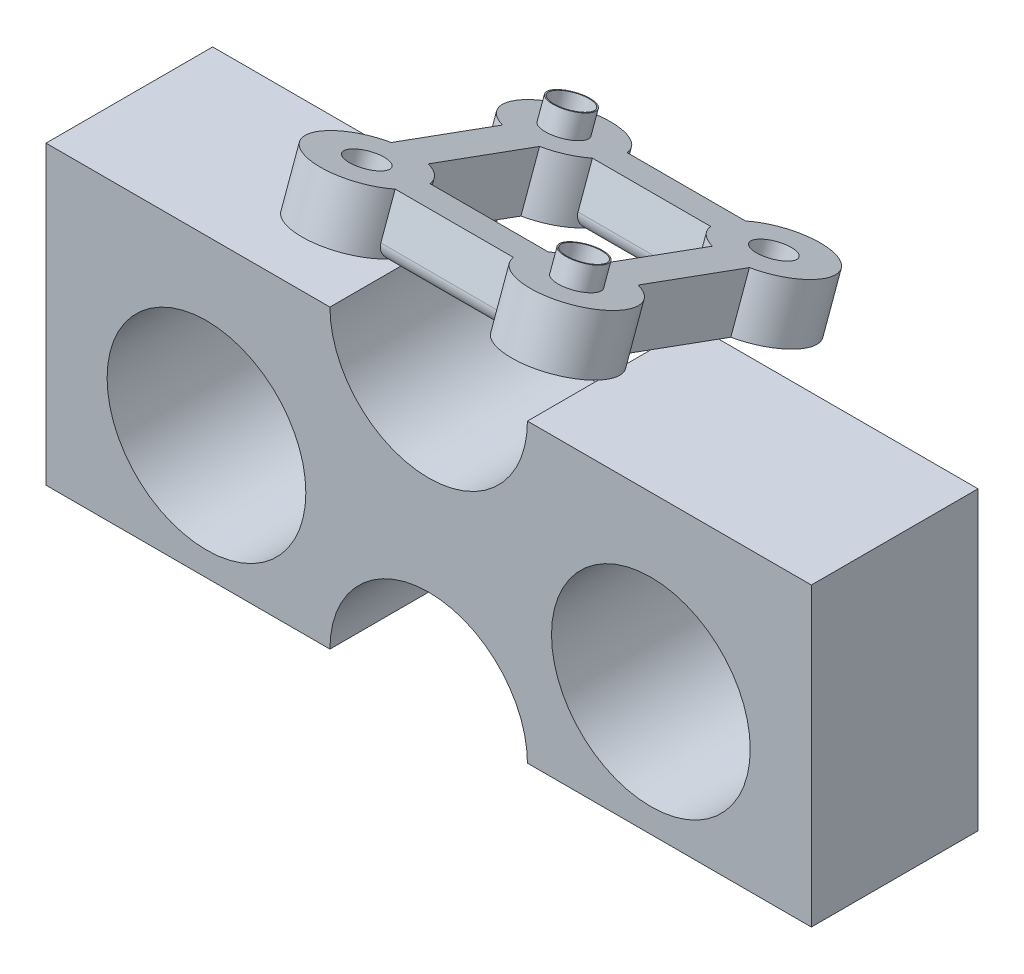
from build123d import *

# Parameters (mm, degrees)
ESQUISSE1_R                     = 8.05
BOSS_EXTRU_1_DEPTH              = 13.5
BOSS_EXTRU_2_DEPTH              = 4.4
ESQUISSE4_R                     = 1.6
BOSS_EXTRU_3_DEPTH              = 1.75
R_P_TITION_LIN_AIRE1_COUNT      = 2
R_P_TITION_LIN_AIRE1_PITCH      = 17
R_P_TITION_LIN_AIRE1_COUNT_DIR2 = 2
R_P_TITION_LIN_AIRE1_PITCH_DIR2 = 17
ENL_V_START                     = -6.15
ESQUISSE5_R                     = 1.5
ENL_V_MAT_EXTRU_1_DEPTH         = 6.15
R_P_TITION_LIN_AIRE2_COUNT      = 2
R_P_TITION_LIN_AIRE2_PITCH      = 17
R_P_TITION_LIN_AIRE2_COUNT_DIR2 = 2
R_P_TITION_LIN_AIRE2_PITCH_DIR2 = 17
ENL_V_MAT_EXTRU_3_DEPTH         = 2.2
R_P_TITION_LIN_AIRE5_COUNT      = 2
R_P_TITION_LIN_AIRE5_PITCH      = 17
R_P_TITION_LIN_AIRE5_COUNT_DIR2 = 2
R_P_TITION_LIN_AIRE5_PITCH_DIR2 = 17
CONG_3_R                        = 1


with BuildPart() as part:
    # Esquisse1 → Boss.-Extru.1 (new body)
    with BuildSketch(Plane.XY):
        with BuildLine():
            Line((39, 24), (62, 24))
            Line((62, 24), (62, 0))
            Line((62, 0), (39, 0))
            ThreePointArc((39, 0), (31, 8), (23, 0))
            Line((23, 0), (0, 0))
            Line((0, 0), (0, 24))
            Line((0, 24), (23, 24))
            ThreePointArc((23, 24), (31, 16), (39, 24))
        make_face()
        with Locations((13, 10)):
            Circle(ESQUISSE1_R, mode=Mode.SUBTRACT)
        with Locations((49, 10)):
            Circle(ESQUISSE1_R, mode=Mode.SUBTRACT)
    extrude(amount=BOSS_EXTRU_1_DEPTH)


with BuildPart() as body_2:
    # Esquisse3 → Boss.-Extru.2 (new body)
    with BuildSketch(Plane(origin=(0, 21.192533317, -7.713451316), x_dir=(-1, 0, 0), z_dir=(0, -0.939692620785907, 0.34202014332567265))):
        with BuildLine():
            Line((-26.208099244, -1.96380283), (-35.791900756, -1.96380283))
            ThreePointArc((-35.791900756, -1.96380283), (-42.328427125, -0.635375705), (-41, -7.171902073))
            Line((-41, -7.171902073), (-41, -16.755703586))
            ThreePointArc((-41, -16.755703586), (-42.328427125, -23.292229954), (-35.791900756, -21.96380283))
            Line((-35.791900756, -21.96380283), (-26.208099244, -21.96380283))
            ThreePointArc((-26.208099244, -21.96380283), (-19.671572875, -23.292229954), (-21, -16.755703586))
            Line((-21, -16.755703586), (-21, -7.171902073))
            ThreePointArc((-21, -7.171902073), (-19.671572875, -0.635375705), (-26.208099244, -1.96380283))
        make_face()
        with BuildLine():
            Line((-26.208099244, -4.96380283), (-35.791900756, -4.96380283))
            ThreePointArc((-35.791900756, -4.96380283), (-36.671572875, -6.292229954), (-38, -7.171902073))
            Line((-38, -7.171902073), (-38, -16.755703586))
            ThreePointArc((-38, -16.755703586), (-36.671572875, -17.635375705), (-35.791900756, -18.96380283))
            Line((-35.791900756, -18.96380283), (-26.208099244, -18.96380283))
            ThreePointArc((-26.208099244, -18.96380283), (-25.328427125, -17.635375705), (-24, -16.755703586))
            Line((-24, -16.755703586), (-24, -7.171902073))
            ThreePointArc((-24, -7.171902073), (-25.328427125, -6.292229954), (-26.208099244, -4.96380283))
        make_face(mode=Mode.SUBTRACT)
    extrude(amount=-BOSS_EXTRU_2_DEPTH)

    # Esquisse4 → Boss.-Extru.3 (add)
    with BuildSketch(Plane(origin=(0, 25.327180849, -9.218339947), x_dir=(1, 0, 0), z_dir=(0, 0.939692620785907, -0.34202014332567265))):
        with Locations(Location((22.5, -3.46380283, 0), (0, 0, 90))):
            Circle(ESQUISSE4_R)
    boss_extru_3 = extrude(amount=BOSS_EXTRU_3_DEPTH)

    # R_p_tition lin_aire1: Boss.-Extru.3 2 × 2, 2 skipped
    with Locations(*[Vector(1, 0, 0) * (i * R_P_TITION_LIN_AIRE1_PITCH) + Vector(0, 0.34202014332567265, 0.939692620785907) * (j * R_P_TITION_LIN_AIRE1_PITCH_DIR2) for i in range(R_P_TITION_LIN_AIRE1_COUNT) for j in range(R_P_TITION_LIN_AIRE1_COUNT_DIR2) if (i, j) not in ((0, 0), (0, 1), (1, 0))]):
        add(boss_extru_3)

    # Esquisse5 → Enl_v. mat.-Extru.1 (cut)
    with BuildSketch(Plane(origin=(0, 21.192533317, -7.713451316), x_dir=(1, 0, 0), z_dir=(0, -0.939692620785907, 0.34202014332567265)).offset(ENL_V_START)):
        with Locations(Location((22.5, 20.46380283, 0), (0, 0, 270))):
            Circle(ESQUISSE5_R)
    enl_v_mat_extru_1 = extrude(amount=ENL_V_MAT_EXTRU_1_DEPTH, mode=Mode.SUBTRACT)

    # R_p_tition lin_aire2: Enl_v. mat.-Extru.1 2 × 2
    with Locations(*[Vector(1, 0, 0) * (i * R_P_TITION_LIN_AIRE2_PITCH) + Vector(0, -0.34202014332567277, -0.939692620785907) * (j * R_P_TITION_LIN_AIRE2_PITCH_DIR2) for i in range(R_P_TITION_LIN_AIRE2_COUNT) for j in range(R_P_TITION_LIN_AIRE2_COUNT_DIR2) if (i, j) != (0, 0)]):
        add(enl_v_mat_extru_1, mode=Mode.SUBTRACT)

    # Esquisse10 → Enl_v. mat.-Extru.3 (cut)
    with BuildSketch(Plane(origin=(0, 21.192533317, -7.713451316), x_dir=(1, 0, 0), z_dir=(0, -0.939692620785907, 0.34202014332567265))):
        Polygon((25.675426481, 20.46380283), (24.08771324, 23.21380283), (20.91228676, 23.21380283), (19.324573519, 20.46380283), (20.91228676, 17.71380283), (24.08771324, 17.71380283), align=None)
    enl_v_mat_extru_3 = extrude(amount=-ENL_V_MAT_EXTRU_3_DEPTH, mode=Mode.SUBTRACT)

    # R_p_tition lin_aire5: Enl_v. mat.-Extru.3 2 × 2
    with Locations(*[Vector(1, 0, 0) * (i * R_P_TITION_LIN_AIRE5_PITCH) + Vector(0, -0.3420201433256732, -0.9396926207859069) * (j * R_P_TITION_LIN_AIRE5_PITCH_DIR2) for i in range(R_P_TITION_LIN_AIRE5_COUNT) for j in range(R_P_TITION_LIN_AIRE5_COUNT_DIR2) if (i, j) != (0, 0)]):
        add(enl_v_mat_extru_3, mode=Mode.SUBTRACT)

    # Cong_3
    cong_3_edges = [body_2.edges().sort_by_distance(p)[0] for p in [
        (31, 21.864193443, -5.868080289),
        (31, 27.678535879, 10.106694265),
        (31, 22.890253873, -3.049002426),
        (31, 28.704596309, 12.925772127),
    ]]
    fillet(cong_3_edges, radius=CONG_3_R)


solid = Compound([part.part, body_2.part])
